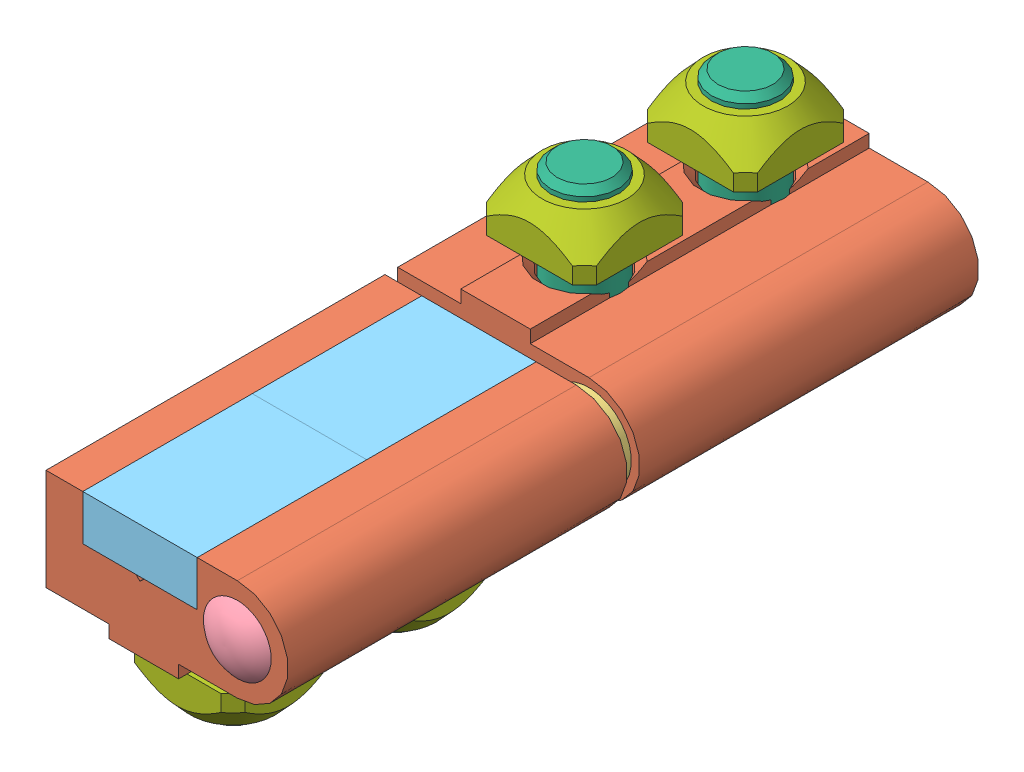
SolidWorks assembly 21.1100 HINGE 19 LEFT HAND.SLDASM, configuration Default (file format 3800). Lengths in mm.
Overall size (29.11 34.61 84.51).
18 component instances, 7 part files, 38 mates.
Components (placement in the parent):
- 21.1096 HINGE PIN-1: 21.1096 HINGE PIN.SLDPRT [Default] at origin size (6.07 6.07 65)
- 21.1100 HINGE 19 AL BLOCK-1: 21.1100 HINGE 19 AL BLOCK.SLDPRT [Default] at (-11.5 6 31.75) x (-1 0 0) z (0 0 1) size (28.58 13.5 40)
- 21.1100 HINGE 19 AL BLOCK-2: 21.1100 HINGE 19 AL BLOCK.SLDPRT [Default] at (-11.5 -6 33.25) x (-1 0 0) z (0 0 -1) size (28.58 13.5 40)
- 21.1096 HINGE WASHER-1: 21.1096 HINGE WASHER.SLDPRT [Default] at (0 0 33.25) x (-0.923728 -0.383049 0) z (0 0 -1) size (10 10 1.5)
- 21.1096 HINGE PIN END CAP-1: 21.1096 HINGE PIN END CAP.SLDPRT [Default] at (0 0 74.75) x (-0.594434 0.804144 0) z (0.804144 0.594434 0) size (8 7 8)
- 21.1096 HINGE PIN END CAP-2: 21.1096 HINGE PIN END CAP.SLDPRT [Default] at (0 0 -9.75) x (0.210938 -0.977499 0) z (0.977499 0.210938 0) size (8 7 8)
- 22.1050 HINGE SCREW CAP-1: 22.1050 HINGE SCREW CAP.SLDPRT [Default] at (-18.2316 6 63.25) x (0 0 -1) z (1 0 0) size (20 5.34 13.5)
- 22.1050 HINGE SCREW CAP-2: 22.1050 HINGE SCREW CAP.SLDPRT [Default] at (-18.2316 6 43.25) x (0 0 -1) z (1 0 0) size (20 5.34 13.5)
- 22.1050 HINGE SCREW CAP-3: 22.1050 HINGE SCREW CAP.SLDPRT [Default] at (-4.7316 -6 21.75) x (0 0 -1) z (-1 0 0) size (20 5.34 13.5)
- 22.1050 HINGE SCREW CAP-4: 22.1050 HINGE SCREW CAP.SLDPRT [Default] at (-4.7316 -6 1.75) x (0 0 -1) z (-1 0 0) size (20 5.34 13.5)
- 21.1268 M8X18-1: 21.1268 M8X18.SLDPRT [Default] at (-11.0292 -0.6971 21.25) x (0 1 0) z (0 0 1) size (23 13 13)
- 21.1268 M8X18-2: 21.1268 M8X18.SLDPRT [Default] at (-11.0292 -0.6971 2.25) x (0 1 0) z (0 0 1) size (23 13 13)
- 21.1268 M8X18-3: 21.1268 M8X18.SLDPRT [Default] at (-11.0292 0.6971 43.75) x (0 -1 0) z (0 0 1) size (23 13 13)
- 21.1268 M8X18-4: 21.1268 M8X18.SLDPRT [Default] at (-11.0292 0.6971 62.75) x (0 -1 0) z (0 0 1) size (23 13 13)
- 21.1351 M8 SQUARE NUT-1: 21.1351 M8 SQUARE NUT.SLDPRT [Default] at (-11.0292 -10.5 62.75) x (1 0 0) z (0 1 0) size (13 13 5.5)
- 21.1351 M8 SQUARE NUT-2: 21.1351 M8 SQUARE NUT.SLDPRT [Default] at (-11.0292 10.5 2.25) x (1 0 0) z (0 -1 0) size (13 13 5.5)
- 21.1351 M8 SQUARE NUT-3: 21.1351 M8 SQUARE NUT.SLDPRT [Default] at (-11.0292 10.5 21.25) x (1 0 0) z (0 -1 0) size (13 13 5.5)
- 21.1351 M8 SQUARE NUT-4: 21.1351 M8 SQUARE NUT.SLDPRT [Default] at (-11.0292 -10.5 43.75) x (1 0 0) z (0 1 0) size (13 13 5.5)
Mates (geometry in assembly coordinates):
- Coincident1: coincident anti-aligned: axis of 21.1096 HINGE PIN-1; axis of 21.1100 HINGE 19 AL BLOCK-1
- Distance1: distance = 33.25 mm aligned: plane of 21.1100 HINGE 19 AL BLOCK-1 through (-9.7205 0.7653 31.75) normal (0 0 1); plane of 21.1096 HINGE PIN-1 through (0 0 65) normal (0 0 1)
- Coincident3: coincident anti-aligned: plane of 21.1096 HINGE WASHER-1 through (0 0 31.75) normal (0 0 -1); plane of 21.1100 HINGE 19 AL BLOCK-1 through (-9.7205 0.7653 31.75) normal (0 0 1)
- Coincident4: coincident anti-aligned: axis of 21.1096 HINGE PIN-1; axis of 21.1096 HINGE WASHER-1
- Coincident5: coincident aligned: axis of 21.1100 HINGE 19 AL BLOCK-2; axis of 21.1096 HINGE PIN-1
- Coincident6: coincident anti-aligned: plane of 21.1100 HINGE 19 AL BLOCK-2 through (-9.7205 -0.7653 33.25) normal (0 0 -1); plane of 21.1096 HINGE WASHER-1 through (0 0 33.25) normal (0 0 1)
- Concentric1: concentric anti-aligned: cylinder of 21.1100 HINGE 19 AL BLOCK-2; cylinder of 21.1096 HINGE PIN END CAP-1
- Coincident8: coincident anti-aligned: plane of 21.1100 HINGE 19 AL BLOCK-2 through (-9.7205 -0.7653 73.25) normal (0 0 1); plane of 21.1096 HINGE PIN END CAP-1 through (-2.1102 2.8547 73.25) normal (0 0 -1)
- Coincident9: coincident anti-aligned: plane of 21.1100 HINGE 19 AL BLOCK-1 through (-9.7205 0.7653 -8.25) normal (0 0 -1); plane of 21.1096 HINGE PIN END CAP-2 through (0.7488 -3.4701 -8.25) normal (0 0 1)
- Coincident10: coincident anti-aligned: axis of 21.1100 HINGE 19 AL BLOCK-1; axis of 21.1096 HINGE PIN END CAP-2
- Coincident11: coincident aligned: plane of 22.1050 HINGE SCREW CAP-4 through (-4.7316 -6 -8.25) normal (0 0 -1); plane of 21.1100 HINGE 19 AL BLOCK-1 through (-9.7205 0.7653 -8.25) normal (0 0 -1)
- Coincident12: coincident anti-aligned: plane of 22.1050 HINGE SCREW CAP-4 through (-18.2316 -4.4369 1.75) normal (-1 0 0); plane of 21.1100 HINGE 19 AL BLOCK-1 through (-18.2316 -6 31.75) normal (1 0 0)
- Coincident13: coincident aligned: plane of 21.1100 HINGE 19 AL BLOCK-1 through (-22.575 -6 31.75) normal (0 -1 0); plane of 22.1050 HINGE SCREW CAP-4 through (-4.7316 -6 11.75) normal (0 -1 0)
- Coincident14: coincident anti-aligned: plane of 22.1050 HINGE SCREW CAP-3 through (-4.7316 -6 11.75) normal (0 0 -1); plane of 22.1050 HINGE SCREW CAP-4 through (-4.7316 -0.66 11.75) normal (0 0 1)
- Coincident15: coincident aligned: plane of 21.1100 HINGE 19 AL BLOCK-1 through (-22.575 -6 31.75) normal (0 -1 0); plane of 22.1050 HINGE SCREW CAP-3 through (-4.7316 -6 31.75) normal (0 -1 0)
- Coincident16: coincident anti-aligned: plane of 21.1100 HINGE 19 AL BLOCK-1 through (-4.7316 -0.6603 31.75) normal (-1 0 0); plane of 22.1050 HINGE SCREW CAP-3 through (-4.7316 -4.4369 21.75) normal (1 0 0)
- Coincident17: coincident aligned: plane of 22.1050 HINGE SCREW CAP-1 through (-18.2316 0.66 73.25) normal (0 0 1); plane of 21.1100 HINGE 19 AL BLOCK-2 through (-9.7205 -0.7653 73.25) normal (0 0 1)
- Coincident18: coincident anti-aligned: plane of 21.1100 HINGE 19 AL BLOCK-2 through (-4.7316 0.6603 33.25) normal (-1 0 0); plane of 22.1050 HINGE SCREW CAP-1 through (-4.7316 4.4369 63.25) normal (1 0 0)
- Coincident19: coincident aligned: plane of 21.1100 HINGE 19 AL BLOCK-2 through (-22.575 6 33.25) normal (0 1 0); plane of 22.1050 HINGE SCREW CAP-1 through (-18.2316 6 73.25) normal (0 1 0)
- Coincident20: coincident anti-aligned: plane of 22.1050 HINGE SCREW CAP-1 through (-18.2316 6 53.25) normal (0 0 -1); plane of 22.1050 HINGE SCREW CAP-2 through (-18.2316 0.66 53.25) normal (0 0 1)
- Coincident21: coincident aligned: plane of 21.1100 HINGE 19 AL BLOCK-2 through (-22.575 6 33.25) normal (0 1 0); plane of 22.1050 HINGE SCREW CAP-2 through (-18.2316 6 53.25) normal (0 1 0)
- Coincident22: coincident anti-aligned: plane of 21.1100 HINGE 19 AL BLOCK-2 through (-18.2316 6 33.25) normal (1 0 0); plane of 22.1050 HINGE SCREW CAP-2 through (-18.2316 4.4369 43.25) normal (-1 0 0)
- Coincident23: coincident anti-aligned: axis of 21.1100 HINGE 19 AL BLOCK-1; axis of 21.1268 M8X18-2
- Coincident24: coincident anti-aligned: axis of 21.1100 HINGE 19 AL BLOCK-1; axis of 21.1268 M8X18-1
- Coincident25: coincident anti-aligned: axis of 21.1100 HINGE 19 AL BLOCK-2; axis of 21.1268 M8X18-3
- Coincident26: coincident anti-aligned: axis of 21.1100 HINGE 19 AL BLOCK-2; axis of 21.1268 M8X18-4
- Coincident27: coincident anti-aligned: plane of 21.1100 HINGE 19 AL BLOCK-2 through (-18.2316 0.6971 33.25) normal (0 1 0); plane of 21.1268 M8X18-4 through (-5.7792 0.6971 62.75) normal (0 -1 0)
- Coincident28: coincident anti-aligned: plane of 21.1100 HINGE 19 AL BLOCK-2 through (-18.2316 0.6971 33.25) normal (0 1 0); plane of 21.1268 M8X18-3 through (-5.7792 0.6971 43.75) normal (0 -1 0)
- Coincident29: coincident anti-aligned: plane of 21.1100 HINGE 19 AL BLOCK-1 through (-18.2316 -0.6971 31.75) normal (0 -1 0); plane of 21.1268 M8X18-2 through (-16.2792 -0.6971 2.25) normal (0 1 0)
- Coincident30: coincident anti-aligned: plane of 21.1100 HINGE 19 AL BLOCK-1 through (-18.2316 -0.6971 31.75) normal (0 -1 0); plane of 21.1268 M8X18-1 through (-16.2792 -0.6971 21.25) normal (0 1 0)
- Coincident31: coincident aligned: axis of 21.1351 M8 SQUARE NUT-2; axis of 21.1268 M8X18-2
- Coincident32: coincident aligned: axis of 21.1351 M8 SQUARE NUT-3; axis of 21.1268 M8X18-1
- Coincident33: coincident aligned: axis of 21.1351 M8 SQUARE NUT-4; axis of 21.1268 M8X18-3
- Coincident34: coincident aligned: axis of 21.1268 M8X18-4; axis of ?
- Distance2: distance = 4.5 mm anti-aligned: plane of 21.1351 M8 SQUARE NUT-2 through (-11.0292 10.5 2.25) normal (0 -1 0); plane of 21.1100 HINGE 19 AL BLOCK-1 through (-15.1292 6 31.75) normal (0 1 0)
- Distance3: distance = 4.5 mm anti-aligned: plane of 21.1100 HINGE 19 AL BLOCK-1 through (0 6 31.75) normal (0 1 0); plane of 21.1351 M8 SQUARE NUT-3 through (-11.0292 10.5 21.25) normal (0 -1 0)
- Distance4: distance = 4.5 mm anti-aligned: plane of 21.1100 HINGE 19 AL BLOCK-2 through (0 -6 33.25) normal (0 -1 0); plane of 21.1351 M8 SQUARE NUT-4 through (-11.0292 -10.5 43.75) normal (0 1 0)
- Distance5: distance = 4.5 mm anti-aligned: plane of 21.1351 M8 SQUARE NUT-1 through (-11.0292 -10.5 62.75) normal (0 1 0); plane of 21.1100 HINGE 19 AL BLOCK-2 through (0 -6 33.25) normal (0 -1 0)
